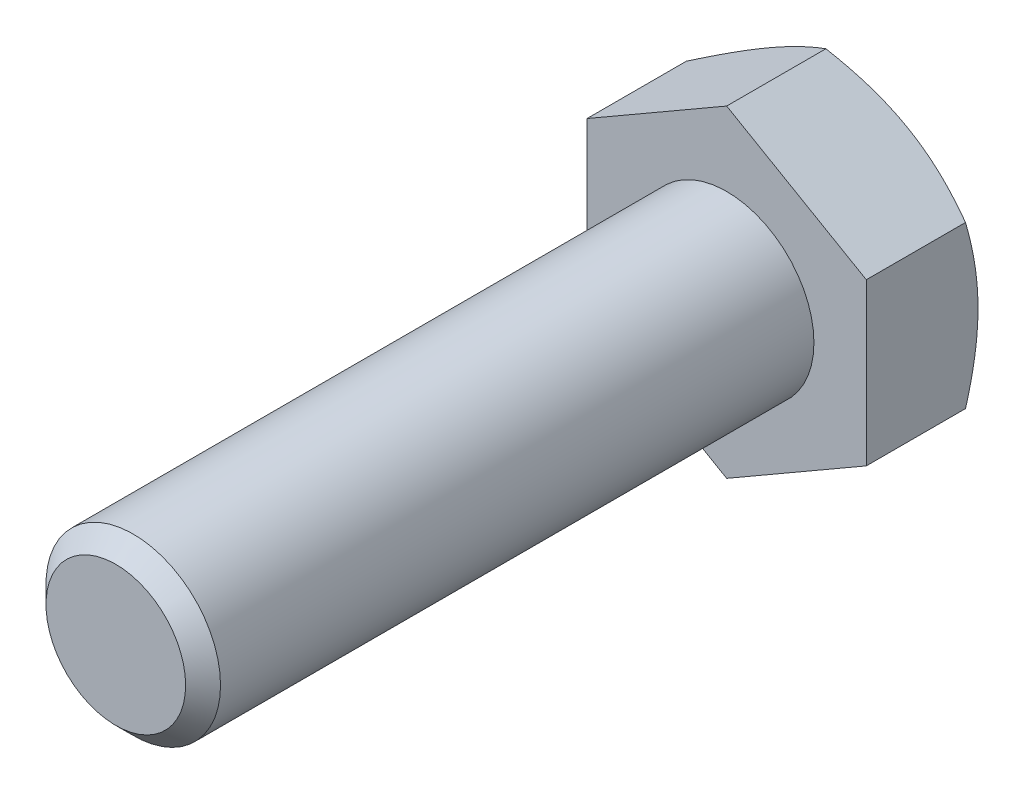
ISO-10303-21;
HEADER;
FILE_DESCRIPTION(('STEP AP214'),'2;1');
FILE_NAME('part.step','',(''),(''),'','','');
FILE_SCHEMA(('AUTOMOTIVE_DESIGN { 1 0 10303 214 1 1 1 1 }'));
ENDSEC;
DATA;
#1=APPLICATION_CONTEXT('core data for automotive mechanical design processes');
#2=APPLICATION_PROTOCOL_DEFINITION('international standard','automotive_design',2000,#1);
#3=PRODUCT_CONTEXT('',#1,'mechanical');
#4=PRODUCT('Part','Part','',(#3));
#5=PRODUCT_RELATED_PRODUCT_CATEGORY('part','',(#4));
#6=PRODUCT_DEFINITION_FORMATION('','',#4);
#7=PRODUCT_DEFINITION_CONTEXT('part definition',#1,'design');
#8=PRODUCT_DEFINITION('design','',#6,#7);
#9=PRODUCT_DEFINITION_SHAPE('','',#8);
#10=(LENGTH_UNIT() NAMED_UNIT(*) SI_UNIT(.MILLI.,.METRE.));
#11=(NAMED_UNIT(*) PLANE_ANGLE_UNIT() SI_UNIT($,.RADIAN.));
#12=(NAMED_UNIT(*) SI_UNIT($,.STERADIAN.) SOLID_ANGLE_UNIT());
#13=UNCERTAINTY_MEASURE_WITH_UNIT(LENGTH_MEASURE(1.E-05),#10,'distance_accuracy_value','');
#14=(GEOMETRIC_REPRESENTATION_CONTEXT(3) GLOBAL_UNCERTAINTY_ASSIGNED_CONTEXT((#13)) GLOBAL_UNIT_ASSIGNED_CONTEXT((#10,
#11,#12)) REPRESENTATION_CONTEXT('',''));
#15=CARTESIAN_POINT('',(0.,0.,0.));
#16=DIRECTION('',(0.,0.,1.));
#17=DIRECTION('',(1.,0.,0.));
#18=AXIS2_PLACEMENT_3D('',#15,#16,#17);
#19=CARTESIAN_POINT('',(0.,-2.22044604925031E-13,35.));
#20=DIRECTION('',(0.,0.,1.));
#21=DIRECTION('',(1.,0.,0.));
#22=AXIS2_PLACEMENT_3D('',#19,#20,#21);
#23=PLANE('',#22);
#24=CARTESIAN_POINT('',(0.,-2.22044604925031E-13,35.));
#25=DIRECTION('',(0.,0.,1.));
#26=DIRECTION('',(1.,0.,0.));
#27=AXIS2_PLACEMENT_3D('',#24,#25,#26);
#28=CIRCLE('',#27,4.);
#29=CARTESIAN_POINT('',(4.00000000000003,-2.21610326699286E-13,35.));
#30=VERTEX_POINT('',#29);
#31=EDGE_CURVE('E211',#30,#30,#28,.T.);
#32=ORIENTED_EDGE('',*,*,#31,.T.);
#33=EDGE_LOOP('',(#32));
#34=FACE_BOUND('',#33,.T.);
#35=ADVANCED_FACE('F37',(#34),#23,.T.);
#36=CARTESIAN_POINT('',(0.,0.,0.));
#37=DIRECTION('',(0.,0.,1.));
#38=DIRECTION('',(1.,0.,0.));
#39=AXIS2_PLACEMENT_3D('',#36,#37,#38);
#40=CYLINDRICAL_SURFACE('',#39,5.);
#41=CARTESIAN_POINT('',(0.,-1.38777878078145E-13,34.));
#42=DIRECTION('',(0.,0.,1.));
#43=DIRECTION('',(1.,0.,0.));
#44=AXIS2_PLACEMENT_3D('',#41,#42,#43);
#45=CIRCLE('',#44,5.);
#46=CARTESIAN_POINT('',(4.99999999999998,-1.38235030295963E-13,34.));
#47=VERTEX_POINT('',#46);
#48=EDGE_CURVE('E213',#47,#47,#45,.F.);
#49=ORIENTED_EDGE('',*,*,#48,.T.);
#50=EDGE_LOOP('',(#49));
#51=FACE_BOUND('',#50,.T.);
#52=CARTESIAN_POINT('',(0.,0.,0.));
#53=DIRECTION('',(0.,0.,1.));
#54=DIRECTION('',(1.,0.,0.));
#55=AXIS2_PLACEMENT_3D('',#52,#53,#54);
#56=CIRCLE('',#55,5.);
#57=CARTESIAN_POINT('',(5.00000000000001,0.,0.));
#58=VERTEX_POINT('',#57);
#59=EDGE_CURVE('E214',#58,#58,#56,.F.);
#60=ORIENTED_EDGE('',*,*,#59,.F.);
#61=EDGE_LOOP('',(#60));
#62=FACE_BOUND('',#61,.T.);
#63=ADVANCED_FACE('F202',(#51,#62),#40,.T.);
#64=CARTESIAN_POINT('',(0.,-2.22044604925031E-13,35.));
#65=DIRECTION('',(0.,0.,-1.));
#66=DIRECTION('',(-1.,0.,0.));
#67=AXIS2_PLACEMENT_3D('',#64,#65,#66);
#68=CONICAL_SURFACE('',#67,4.,0.785398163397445);
#69=ORIENTED_EDGE('',*,*,#48,.F.);
#70=EDGE_LOOP('',(#69));
#71=FACE_BOUND('',#70,.T.);
#72=ORIENTED_EDGE('',*,*,#31,.F.);
#73=EDGE_LOOP('',(#72));
#74=FACE_BOUND('',#73,.T.);
#75=ADVANCED_FACE('F207',(#71,#74),#68,.T.);
#76=CARTESIAN_POINT('',(0.,9.23760430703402,-6.39999999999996));
#77=DIRECTION('',(0.499999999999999,0.866025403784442,0.));
#78=DIRECTION('',(-0.866025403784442,0.499999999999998,0.));
#79=AXIS2_PLACEMENT_3D('',#76,#77,#78);
#80=PLANE('',#79);
#81=CARTESIAN_POINT('',(-0.000200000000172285,9.23771977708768,-5.685402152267));
#82=CARTESIAN_POINT('',(0.175648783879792,9.13619343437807,-5.74400928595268));
#83=CARTESIAN_POINT('',(0.352153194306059,9.03428856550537,-5.79995659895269));
#84=CARTESIAN_POINT('',(0.706595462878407,8.829651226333,-5.90579899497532));
#85=CARTESIAN_POINT('',(0.884533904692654,8.72691841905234,-5.95569146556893));
#86=CARTESIAN_POINT('',(1.42119823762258,8.41707512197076,-6.09530720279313));
#87=CARTESIAN_POINT('',(1.78204258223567,8.20874154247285,-6.17471882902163));
#88=CARTESIAN_POINT('',(2.322039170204,7.89697436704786,-6.26783835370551));
#89=CARTESIAN_POINT('',(2.49957818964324,7.79447216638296,-6.29436541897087));
#90=CARTESIAN_POINT('',(2.85545911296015,7.58900421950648,-6.33884682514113));
#91=CARTESIAN_POINT('',(3.03380094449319,7.48603851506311,-6.35680192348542));
#92=CARTESIAN_POINT('',(3.39079168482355,7.27992981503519,-6.38368435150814));
#93=CARTESIAN_POINT('',(3.56944001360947,7.17678715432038,-6.39262192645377));
#94=CARTESIAN_POINT('',(3.92690170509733,6.97040655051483,-6.40127769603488));
#95=CARTESIAN_POINT('',(4.10571506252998,6.86716861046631,-6.40099617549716));
#96=CARTESIAN_POINT('',(4.44001336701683,6.6741613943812,-6.39185497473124));
#97=CARTESIAN_POINT('',(4.59552190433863,6.58437849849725,-6.38411039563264));
#98=CARTESIAN_POINT('',(4.9061747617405,6.40502298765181,-6.36179886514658));
#99=CARTESIAN_POINT('',(5.06131905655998,6.31545038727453,-6.34723145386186));
#100=CARTESIAN_POINT('',(5.5261513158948,6.04707935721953,-6.29363930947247));
#101=CARTESIAN_POINT('',(5.83501648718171,5.86875596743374,-6.24473135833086));
#102=CARTESIAN_POINT('',(6.45602322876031,5.51021755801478,-6.12246059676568));
#103=CARTESIAN_POINT('',(6.7680855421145,5.3300482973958,-6.04857947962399));
#104=CARTESIAN_POINT('',(7.38755648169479,4.97239658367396,-5.88089985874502));
#105=CARTESIAN_POINT('',(7.69497304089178,4.7949095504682,-5.78714073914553));
#106=CARTESIAN_POINT('',(8.00020000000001,4.61868668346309,-5.68540215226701));
#107=B_SPLINE_CURVE_WITH_KNOTS('',3,(#81,#82,#83,#84,#85,#86,#87,#88,#89,#90,#91,#92,#93,#94,
#95,#96,#97,#98,#99,#100,#101,#102,#103,#104,#105,#106),.UNSPECIFIED.,.F.,.F.,(4,2,2,2,2,2,2,2,
2,2,2,2,4),(0.,0.633973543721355,1.26821965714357,2.53934712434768,3.15934343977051,
3.77928496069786,4.39852133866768,5.01773858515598,5.55680239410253,6.09590254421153,
7.17487077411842,8.27776850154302,9.37850115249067),.UNSPECIFIED.);
#108=CARTESIAN_POINT('',(0.,9.23760430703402,-5.68546882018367));
#109=VERTEX_POINT('',#108);
#110=CARTESIAN_POINT('',(3.99999999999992,6.92820323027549,-6.39999999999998));
#111=VERTEX_POINT('',#110);
#112=EDGE_CURVE('E247',#109,#111,#107,.T.);
#113=ORIENTED_EDGE('',*,*,#112,.F.);
#114=DIRECTION('',(0.,0.,1.));
#115=VECTOR('',#114,1.);
#116=CARTESIAN_POINT('',(0.,9.23760430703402,-6.39999999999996));
#117=LINE('',#116,#115);
#118=CARTESIAN_POINT('',(0.,9.23760430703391,0.));
#119=VERTEX_POINT('',#118);
#120=EDGE_CURVE('E221',#109,#119,#117,.T.);
#121=ORIENTED_EDGE('',*,*,#120,.T.);
#122=DIRECTION('',(-0.866025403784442,0.499999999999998,0.));
#123=VECTOR('',#122,1.);
#124=CARTESIAN_POINT('',(0.,9.23760430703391,0.));
#125=LINE('',#124,#123);
#126=CARTESIAN_POINT('',(7.99999999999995,4.61880215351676,0.));
#127=VERTEX_POINT('',#126);
#128=EDGE_CURVE('E245',#127,#119,#125,.T.);
#129=ORIENTED_EDGE('',*,*,#128,.F.);
#130=DIRECTION('',(0.,0.,1.));
#131=VECTOR('',#130,1.);
#132=CARTESIAN_POINT('',(8.00000000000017,4.61880215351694,-6.39999999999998));
#133=LINE('',#132,#131);
#134=CARTESIAN_POINT('',(7.99999999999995,4.61880215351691,-5.68546882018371));
#135=VERTEX_POINT('',#134);
#136=EDGE_CURVE('E218',#135,#127,#133,.T.);
#137=ORIENTED_EDGE('',*,*,#136,.F.);
#138=EDGE_CURVE('E177',#111,#135,#107,.T.);
#139=ORIENTED_EDGE('',*,*,#138,.F.);
#140=EDGE_LOOP('',(#113,#121,#129,#137,#139));
#141=FACE_BOUND('',#140,.T.);
#142=ADVANCED_FACE('F187',(#141),#80,.T.);
#143=CARTESIAN_POINT('',(8.00000000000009,-4.61880215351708,-6.39999999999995));
#144=DIRECTION('',(1.,0.,0.));
#145=DIRECTION('',(0.,1.,0.));
#146=AXIS2_PLACEMENT_3D('',#143,#144,#145);
#147=PLANE('',#146);
#148=CARTESIAN_POINT('',(7.99999999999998,-12.5978512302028,-2.40281206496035));
#149=CARTESIAN_POINT('',(8.00000000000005,-12.2467461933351,-2.57388946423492));
#150=CARTESIAN_POINT('',(8.00000000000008,-11.8948553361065,-2.74338074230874));
#151=CARTESIAN_POINT('',(8.0000000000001,-11.1890846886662,-3.07830251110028));
#152=CARTESIAN_POINT('',(8.00000000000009,-10.835204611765,-3.24373239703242));
#153=CARTESIAN_POINT('',(8.00000000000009,-10.123305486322,-3.57043443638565));
#154=CARTESIAN_POINT('',(8.00000000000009,-9.76527449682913,-3.73168065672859));
#155=CARTESIAN_POINT('',(8.00000000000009,-9.04643054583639,-4.04782365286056));
#156=CARTESIAN_POINT('',(8.00000000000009,-8.68561771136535,-4.20272071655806));
#157=CARTESIAN_POINT('',(8.00000000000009,-7.94836823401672,-4.50960168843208));
#158=CARTESIAN_POINT('',(8.00000000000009,-7.57181608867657,-4.66130959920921));
#159=CARTESIAN_POINT('',(8.00000000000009,-6.81437869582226,-4.95369969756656));
#160=CARTESIAN_POINT('',(8.00000000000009,-6.43349297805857,-5.09438067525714));
#161=CARTESIAN_POINT('',(8.00000000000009,-5.66743059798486,-5.36116349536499));
#162=CARTESIAN_POINT('',(8.00000000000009,-5.28226375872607,-5.48729325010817));
#163=CARTESIAN_POINT('',(8.00000000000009,-4.50642197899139,-5.7210548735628));
#164=CARTESIAN_POINT('',(8.00000000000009,-4.1157487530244,-5.82869236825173));
#165=CARTESIAN_POINT('',(8.00000000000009,-3.3307685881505,-6.01985550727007));
#166=CARTESIAN_POINT('',(8.00000000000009,-2.93649538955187,-6.10351603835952));
#167=CARTESIAN_POINT('',(8.00000000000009,-2.34134760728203,-6.20749259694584));
#168=CARTESIAN_POINT('',(8.00000000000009,-2.14232908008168,-6.23856705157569));
#169=CARTESIAN_POINT('',(8.00000000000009,-1.74323916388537,-6.29294025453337));
#170=CARTESIAN_POINT('',(8.00000000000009,-1.54316787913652,-6.31623975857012));
#171=CARTESIAN_POINT('',(8.00000000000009,-1.14493807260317,-6.3542962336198));
#172=CARTESIAN_POINT('',(8.0000000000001,-0.946790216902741,-6.36916434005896));
#173=CARTESIAN_POINT('',(8.00000000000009,-0.55004265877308,-6.3905000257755));
#174=CARTESIAN_POINT('',(8.00000000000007,-0.351442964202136,-6.39696775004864));
#175=CARTESIAN_POINT('',(8.00000000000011,0.0458536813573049,-6.40134753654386));
#176=CARTESIAN_POINT('',(8.00000000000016,0.244550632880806,-6.39925955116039));
#177=CARTESIAN_POINT('',(8.00000000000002,0.641675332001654,-6.38658102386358));
#178=CARTESIAN_POINT('',(7.99999999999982,0.840103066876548,-6.3759900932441));
#179=CARTESIAN_POINT('',(7.99999999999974,1.31123186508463,-6.34097810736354));
#180=CARTESIAN_POINT('',(7.99999999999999,1.58366327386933,-6.31284309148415));
#181=CARTESIAN_POINT('',(8.00000000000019,2.12661564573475,-6.24203710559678));
#182=CARTESIAN_POINT('',(8.00000000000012,2.39713636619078,-6.19936432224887));
#183=CARTESIAN_POINT('',(8.00000000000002,3.20545284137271,-6.05179305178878));
#184=CARTESIAN_POINT('',(8.00000000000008,3.73973646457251,-5.92736416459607));
#185=CARTESIAN_POINT('',(8.0000000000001,4.53906436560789,-5.7101299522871));
#186=CARTESIAN_POINT('',(8.00000000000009,4.80821183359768,-5.6315418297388));
#187=CARTESIAN_POINT('',(8.00000000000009,5.34389592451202,-5.46584170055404));
#188=CARTESIAN_POINT('',(8.00000000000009,5.61043252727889,-5.37872962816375));
#189=CARTESIAN_POINT('',(8.00000000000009,6.14097486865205,-5.19740915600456));
#190=CARTESIAN_POINT('',(8.0000000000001,6.4049812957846,-5.10320275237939));
#191=CARTESIAN_POINT('',(8.00000000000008,6.93077992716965,-4.90883812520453));
#192=CARTESIAN_POINT('',(8.00000000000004,7.19257218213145,-4.8086800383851));
#193=CARTESIAN_POINT('',(8.00000000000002,7.89757234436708,-4.53123135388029));
#194=CARTESIAN_POINT('',(8.00000000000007,8.33892089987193,-4.34922056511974));
#195=CARTESIAN_POINT('',(8.00000000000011,9.21706508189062,-3.97449001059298));
#196=CARTESIAN_POINT('',(8.0000000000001,9.65386019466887,-3.78176905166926));
#197=CARTESIAN_POINT('',(8.00000000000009,10.5239434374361,-3.38815487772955));
#198=CARTESIAN_POINT('',(8.00000000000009,10.9572301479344,-3.18725853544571));
#199=CARTESIAN_POINT('',(8.00000000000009,11.8208356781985,-2.77925077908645));
#200=CARTESIAN_POINT('',(8.00000000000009,12.251154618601,-2.57213961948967));
#201=CARTESIAN_POINT('',(8.00000000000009,13.110106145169,-2.15271844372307));
#202=CARTESIAN_POINT('',(8.00000000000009,13.5387348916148,-1.94040058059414));
#203=CARTESIAN_POINT('',(8.00000000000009,14.3940561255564,-1.51189757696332));
#204=CARTESIAN_POINT('',(8.00000000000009,14.820748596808,-1.29571240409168));
#205=CARTESIAN_POINT('',(8.00000000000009,15.672448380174,-0.860283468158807));
#206=CARTESIAN_POINT('',(8.00000000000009,16.0974560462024,-0.641040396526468));
#207=CARTESIAN_POINT('',(8.00000000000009,16.9461557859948,-0.200021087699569));
#208=CARTESIAN_POINT('',(8.00000000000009,17.3698478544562,0.021755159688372));
#209=CARTESIAN_POINT('',(8.00000000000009,18.5495919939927,0.642968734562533));
#210=CARTESIAN_POINT('',(8.00000000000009,19.3044430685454,1.0446864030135));
#211=CARTESIAN_POINT('',(8.00000000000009,20.8116128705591,1.85294502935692));
#212=CARTESIAN_POINT('',(8.00000000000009,21.5639314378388,2.25948628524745));
#213=CARTESIAN_POINT('',(8.00000000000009,23.0640825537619,3.07479055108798));
#214=CARTESIAN_POINT('',(8.00000000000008,23.8119216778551,3.48354147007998));
#215=CARTESIAN_POINT('',(8.0000000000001,24.9325210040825,4.09870759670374));
#216=CARTESIAN_POINT('',(8.0000000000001,25.3058462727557,4.30409483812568));
#217=CARTESIAN_POINT('',(8.00000000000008,26.0521604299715,4.71547851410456));
#218=CARTESIAN_POINT('',(8.00000000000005,26.4251493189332,4.92147494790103));
#219=CARTESIAN_POINT('',(7.99999999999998,26.7979906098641,5.12773824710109));
#220=B_SPLINE_CURVE_WITH_KNOTS('',3,(#148,#149,#150,#151,#152,#153,#154,#155,#156,#157,#158,
#159,#160,#161,#162,#163,#164,#165,#166,#167,#168,#169,#170,#171,#172,#173,#174,#175,#176,#177,
#178,#179,#180,#181,#182,#183,#184,#185,#186,#187,#188,#189,#190,#191,#192,#193,#194,#195,#196,
#197,#198,#199,#200,#201,#202,#203,#204,#205,#206,#207,#208,#209,#210,#211,#212,#213,#214,#215,
#216,#217,#218,#219),.UNSPECIFIED.,.F.,.F.,(4,2,2,2,2,2,2,2,2,2,2,2,2,2,2,2,2,2,2,2,2,2,2,2,2,2,
2,2,2,2,2,2,2,2,2,4),(0.,1.17171303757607,2.34359951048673,3.5215477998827,4.69944261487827,
5.91720060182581,7.13509201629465,8.35060698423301,9.56575149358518,10.7739194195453,
11.3780811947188,11.982184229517,12.5781274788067,13.174060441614,13.7699967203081,
14.3659602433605,15.1871414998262,16.0084252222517,17.651791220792,18.4928743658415,
19.3339639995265,20.1748178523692,21.0156523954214,22.4476587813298,23.8798250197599,
25.312544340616,26.7452050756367,28.1801767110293,29.6151603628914,31.0498246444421,
32.4844947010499,35.0497345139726,37.6151336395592,40.1718943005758,41.4501744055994,
42.7284529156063),.UNSPECIFIED.);
#221=CARTESIAN_POINT('',(8.00000000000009,-1.38777878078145E-13,-6.4));
#222=VERTEX_POINT('',#221);
#223=EDGE_CURVE('E175',#135,#222,#220,.F.);
#224=ORIENTED_EDGE('',*,*,#223,.F.);
#225=ORIENTED_EDGE('',*,*,#136,.T.);
#226=DIRECTION('',(0.,1.,0.));
#227=VECTOR('',#226,1.);
#228=CARTESIAN_POINT('',(8.00000000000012,-4.61880215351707,0.));
#229=LINE('',#228,#227);
#230=CARTESIAN_POINT('',(8.00000000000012,-4.61880215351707,0.));
#231=VERTEX_POINT('',#230);
#232=EDGE_CURVE('E223',#231,#127,#229,.T.);
#233=ORIENTED_EDGE('',*,*,#232,.F.);
#234=DIRECTION('',(0.,0.,1.));
#235=VECTOR('',#234,1.);
#236=CARTESIAN_POINT('',(8.00000000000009,-4.61880215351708,-6.39999999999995));
#237=LINE('',#236,#235);
#238=CARTESIAN_POINT('',(8.00000000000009,-4.61880215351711,-5.68546882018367));
#239=VERTEX_POINT('',#238);
#240=EDGE_CURVE('E229',#239,#231,#237,.T.);
#241=ORIENTED_EDGE('',*,*,#240,.F.);
#242=EDGE_CURVE('E170',#222,#239,#220,.F.);
#243=ORIENTED_EDGE('',*,*,#242,.F.);
#244=EDGE_LOOP('',(#224,#225,#233,#241,#243));
#245=FACE_BOUND('',#244,.T.);
#246=ADVANCED_FACE('F183',(#245),#147,.T.);
#247=CARTESIAN_POINT('',(-1.66533453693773E-13,-9.23760430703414,-6.4));
#248=DIRECTION('',(0.499999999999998,-0.866025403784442,0.));
#249=DIRECTION('',(0.866025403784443,0.499999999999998,0.));
#250=AXIS2_PLACEMENT_3D('',#247,#248,#249);
#251=PLANE('',#250);
#252=CARTESIAN_POINT('',(8.00020000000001,-4.61868668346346,-5.68540215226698));
#253=CARTESIAN_POINT('',(7.82435121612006,-4.72021302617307,-5.74400928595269));
#254=CARTESIAN_POINT('',(7.64784680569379,-4.82211789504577,-5.7999565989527));
#255=CARTESIAN_POINT('',(7.29340453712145,-5.02675523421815,-5.90579899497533));
#256=CARTESIAN_POINT('',(7.1154660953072,-5.1294880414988,-5.95569146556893));
#257=CARTESIAN_POINT('',(6.57880176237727,-5.43933133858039,-6.09530720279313));
#258=CARTESIAN_POINT('',(6.21795741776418,-5.6476649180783,-6.17471882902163));
#259=CARTESIAN_POINT('',(5.67796082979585,-5.95943209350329,-6.2678383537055));
#260=CARTESIAN_POINT('',(5.50042181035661,-6.06193429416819,-6.29436541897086));
#261=CARTESIAN_POINT('',(5.14454088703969,-6.26740224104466,-6.33884682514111));
#262=CARTESIAN_POINT('',(4.96619905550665,-6.37036794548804,-6.35680192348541));
#263=CARTESIAN_POINT('',(4.60920831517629,-6.57647664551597,-6.38368435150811));
#264=CARTESIAN_POINT('',(4.43055998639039,-6.6796193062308,-6.39262192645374));
#265=CARTESIAN_POINT('',(4.0730982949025,-6.88599991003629,-6.40127769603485));
#266=CARTESIAN_POINT('',(3.8942849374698,-6.98923785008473,-6.40099617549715));
#267=CARTESIAN_POINT('',(3.55998663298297,-7.18224506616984,-6.39185497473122));
#268=CARTESIAN_POINT('',(3.40447809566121,-7.27202796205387,-6.3841103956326));
#269=CARTESIAN_POINT('',(3.09382523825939,-7.45138347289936,-6.36179886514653));
#270=CARTESIAN_POINT('',(2.9386809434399,-7.54095607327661,-6.34723145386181));
#271=CARTESIAN_POINT('',(2.47384868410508,-7.80932710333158,-6.29363930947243));
#272=CARTESIAN_POINT('',(2.16498351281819,-7.98765049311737,-6.24473135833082));
#273=CARTESIAN_POINT('',(1.54397677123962,-8.34618890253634,-6.12246059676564));
#274=CARTESIAN_POINT('',(1.23191445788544,-8.5263581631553,-6.04857947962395));
#275=CARTESIAN_POINT('',(0.612443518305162,-8.88400987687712,-5.88089985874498));
#276=CARTESIAN_POINT('',(0.305026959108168,-9.06149691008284,-5.78714073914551));
#277=CARTESIAN_POINT('',(-0.000200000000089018,-9.23771977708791,-5.68540215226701));
#278=B_SPLINE_CURVE_WITH_KNOTS('',3,(#252,#253,#254,#255,#256,#257,#258,#259,#260,#261,#262,
#263,#264,#265,#266,#267,#268,#269,#270,#271,#272,#273,#274,#275,#276,#277),.UNSPECIFIED.,.F.,
.F.,(4,2,2,2,2,2,2,2,2,2,2,2,4),(0.,0.633973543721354,1.26821965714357,2.53934712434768,
3.15934343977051,3.77928496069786,4.39852133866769,5.01773858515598,5.55680239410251,
6.09590254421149,7.17487077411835,8.27776850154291,9.37850115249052),.UNSPECIFIED.);
#279=CARTESIAN_POINT('',(4.00000000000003,-6.92820323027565,-6.39999999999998));
#280=VERTEX_POINT('',#279);
#281=EDGE_CURVE('E176',#239,#280,#278,.T.);
#282=ORIENTED_EDGE('',*,*,#281,.F.);
#283=ORIENTED_EDGE('',*,*,#240,.T.);
#284=DIRECTION('',(0.866025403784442,0.499999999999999,0.));
#285=VECTOR('',#284,1.);
#286=CARTESIAN_POINT('',(-1.38777878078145E-13,-9.23760430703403,0.));
#287=LINE('',#286,#285);
#288=CARTESIAN_POINT('',(-1.38777878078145E-13,-9.23760430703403,0.));
#289=VERTEX_POINT('',#288);
#290=EDGE_CURVE('E234',#289,#231,#287,.T.);
#291=ORIENTED_EDGE('',*,*,#290,.F.);
#292=DIRECTION('',(0.,0.,1.));
#293=VECTOR('',#292,1.);
#294=CARTESIAN_POINT('',(-1.66533453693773E-13,-9.23760430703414,-6.4));
#295=LINE('',#294,#293);
#296=CARTESIAN_POINT('',(0.,-9.23760430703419,-5.68546882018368));
#297=VERTEX_POINT('',#296);
#298=EDGE_CURVE('E227',#297,#289,#295,.T.);
#299=ORIENTED_EDGE('',*,*,#298,.F.);
#300=EDGE_CURVE('E164',#280,#297,#278,.T.);
#301=ORIENTED_EDGE('',*,*,#300,.F.);
#302=EDGE_LOOP('',(#282,#283,#291,#299,#301));
#303=FACE_BOUND('',#302,.T.);
#304=ADVANCED_FACE('F186',(#303),#251,.T.);
#305=CARTESIAN_POINT('',(-1.66533453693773E-13,-9.23760430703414,-6.4));
#306=DIRECTION('',(-0.500000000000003,-0.866025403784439,0.));
#307=DIRECTION('',(0.86602540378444,-0.500000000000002,0.));
#308=AXIS2_PLACEMENT_3D('',#305,#306,#307);
#309=PLANE('',#308);
#310=CARTESIAN_POINT('',(0.000200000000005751,-9.23771977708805,-5.68540215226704));
#311=CARTESIAN_POINT('',(-0.175648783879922,-9.13619343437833,-5.74400928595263));
#312=CARTESIAN_POINT('',(-0.352153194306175,-9.03428856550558,-5.7999565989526));
#313=CARTESIAN_POINT('',(-0.706595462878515,-8.82965122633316,-5.9057989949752));
#314=CARTESIAN_POINT('',(-0.884533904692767,-8.72691841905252,-5.95569146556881));
#315=CARTESIAN_POINT('',(-1.42119823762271,-8.41707512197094,-6.09530720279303));
#316=CARTESIAN_POINT('',(-1.78204258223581,-8.20874154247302,-6.17471882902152));
#317=CARTESIAN_POINT('',(-2.32203917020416,-7.89697436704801,-6.2678383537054));
#318=CARTESIAN_POINT('',(-2.4995781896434,-7.7944721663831,-6.29436541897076));
#319=CARTESIAN_POINT('',(-2.85545911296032,-7.58900421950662,-6.33884682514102));
#320=CARTESIAN_POINT('',(-3.03380094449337,-7.48603851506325,-6.35680192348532));
#321=CARTESIAN_POINT('',(-3.39079168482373,-7.2799298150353,-6.38368435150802));
#322=CARTESIAN_POINT('',(-3.56944001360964,-7.17678715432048,-6.39262192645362));
#323=CARTESIAN_POINT('',(-3.92690170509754,-6.97040655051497,-6.4012776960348));
#324=CARTESIAN_POINT('',(-4.10571506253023,-6.86716861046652,-6.40099617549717));
#325=CARTESIAN_POINT('',(-4.44001336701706,-6.67416139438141,-6.39185497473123));
#326=CARTESIAN_POINT('',(-4.59552190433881,-6.5843784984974,-6.38411039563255));
#327=CARTESIAN_POINT('',(-4.90617476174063,-6.40502298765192,-6.36179886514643));
#328=CARTESIAN_POINT('',(-5.06131905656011,-6.31545038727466,-6.34723145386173));
#329=CARTESIAN_POINT('',(-5.52615131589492,-6.04707935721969,-6.29363930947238));
#330=CARTESIAN_POINT('',(-5.83501648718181,-5.8687559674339,-6.24473135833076));
#331=CARTESIAN_POINT('',(-6.45602322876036,-5.51021755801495,-6.12246059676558));
#332=CARTESIAN_POINT('',(-6.76808554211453,-5.33004829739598,-6.0485794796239));
#333=CARTESIAN_POINT('',(-7.38755648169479,-4.97239658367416,-5.88089985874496));
#334=CARTESIAN_POINT('',(-7.69497304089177,-4.79490955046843,-5.78714073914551));
#335=CARTESIAN_POINT('',(-8.00020000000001,-4.61868668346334,-5.68540215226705));
#336=B_SPLINE_CURVE_WITH_KNOTS('',3,(#310,#311,#312,#313,#314,#315,#316,#317,#318,#319,#320,
#321,#322,#323,#324,#325,#326,#327,#328,#329,#330,#331,#332,#333,#334,#335),.UNSPECIFIED.,.F.,
.F.,(4,2,2,2,2,2,2,2,2,2,2,2,4),(0.,0.63397354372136,1.26821965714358,2.53934712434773,
3.15934343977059,3.77928496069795,4.39852133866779,5.01773858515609,5.5568023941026,
6.09590254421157,7.1748707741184,8.27776850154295,9.37850115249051),.UNSPECIFIED.);
#337=CARTESIAN_POINT('',(-4.00000000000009,-6.92820323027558,-6.40000000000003));
#338=VERTEX_POINT('',#337);
#339=EDGE_CURVE('E266',#297,#338,#336,.T.);
#340=ORIENTED_EDGE('',*,*,#339,.F.);
#341=ORIENTED_EDGE('',*,*,#298,.T.);
#342=DIRECTION('',(0.86602540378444,-0.500000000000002,0.));
#343=VECTOR('',#342,1.);
#344=CARTESIAN_POINT('',(-1.38777878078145E-13,-9.23760430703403,0.));
#345=LINE('',#344,#343);
#346=CARTESIAN_POINT('',(-8.00000000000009,-4.61880215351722,0.));
#347=VERTEX_POINT('',#346);
#348=EDGE_CURVE('E237',#347,#289,#345,.T.);
#349=ORIENTED_EDGE('',*,*,#348,.F.);
#350=DIRECTION('',(0.,0.,1.));
#351=VECTOR('',#350,1.);
#352=CARTESIAN_POINT('',(-8.00000000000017,-4.61880215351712,-6.40000000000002));
#353=LINE('',#352,#351);
#354=CARTESIAN_POINT('',(-8.00000000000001,-4.6188021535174,-5.68546882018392));
#355=VERTEX_POINT('',#354);
#356=EDGE_CURVE('E225',#355,#347,#353,.T.);
#357=ORIENTED_EDGE('',*,*,#356,.F.);
#358=EDGE_CURVE('E113',#338,#355,#336,.T.);
#359=ORIENTED_EDGE('',*,*,#358,.F.);
#360=EDGE_LOOP('',(#340,#341,#349,#357,#359));
#361=FACE_BOUND('',#360,.T.);
#362=ADVANCED_FACE('F191',(#361),#309,.T.);
#363=CARTESIAN_POINT('',(-8.00000000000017,-4.61880215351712,-6.40000000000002));
#364=DIRECTION('',(-1.,0.,0.));
#365=DIRECTION('',(0.,0.,1.));
#366=AXIS2_PLACEMENT_3D('',#363,#364,#365);
#367=PLANE('',#366);
#368=CARTESIAN_POINT('',(-8.00000000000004,-12.5978512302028,-2.40281206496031));
#369=CARTESIAN_POINT('',(-8.00000000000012,-12.246746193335,-2.5738894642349));
#370=CARTESIAN_POINT('',(-8.00000000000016,-11.8948553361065,-2.74338074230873));
#371=CARTESIAN_POINT('',(-8.00000000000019,-11.1890846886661,-3.07830251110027));
#372=CARTESIAN_POINT('',(-8.00000000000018,-10.835204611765,-3.24373239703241));
#373=CARTESIAN_POINT('',(-8.00000000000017,-10.1233054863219,-3.57043443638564));
#374=CARTESIAN_POINT('',(-8.00000000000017,-9.76527449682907,-3.73168065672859));
#375=CARTESIAN_POINT('',(-8.00000000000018,-9.04643054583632,-4.04782365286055));
#376=CARTESIAN_POINT('',(-8.00000000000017,-8.68561771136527,-4.20272071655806));
#377=CARTESIAN_POINT('',(-8.00000000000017,-7.94836823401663,-4.50960168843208));
#378=CARTESIAN_POINT('',(-8.00000000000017,-7.57181608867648,-4.66130959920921));
#379=CARTESIAN_POINT('',(-8.00000000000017,-6.81437869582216,-4.95369969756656));
#380=CARTESIAN_POINT('',(-8.00000000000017,-6.43349297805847,-5.09438067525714));
#381=CARTESIAN_POINT('',(-8.00000000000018,-5.66743059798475,-5.36116349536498));
#382=CARTESIAN_POINT('',(-8.00000000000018,-5.28226375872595,-5.48729325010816));
#383=CARTESIAN_POINT('',(-8.00000000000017,-4.50642197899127,-5.7210548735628));
#384=CARTESIAN_POINT('',(-8.00000000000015,-4.11574875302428,-5.82869236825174));
#385=CARTESIAN_POINT('',(-8.00000000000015,-3.33076858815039,-6.01985550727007));
#386=CARTESIAN_POINT('',(-8.00000000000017,-2.93649538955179,-6.10351603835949));
#387=CARTESIAN_POINT('',(-8.00000000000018,-2.34134760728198,-6.2074925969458));
#388=CARTESIAN_POINT('',(-8.00000000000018,-2.14232908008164,-6.23856705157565));
#389=CARTESIAN_POINT('',(-8.00000000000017,-1.74323916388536,-6.29294025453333));
#390=CARTESIAN_POINT('',(-8.00000000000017,-1.54316787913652,-6.31623975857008));
#391=CARTESIAN_POINT('',(-8.00000000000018,-1.14493807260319,-6.35429623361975));
#392=CARTESIAN_POINT('',(-8.00000000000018,-0.946790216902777,-6.36916434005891));
#393=CARTESIAN_POINT('',(-8.00000000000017,-0.55004265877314,-6.39050002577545));
#394=CARTESIAN_POINT('',(-8.00000000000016,-0.351442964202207,-6.39696775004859));
#395=CARTESIAN_POINT('',(-8.00000000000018,0.0458536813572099,-6.40134753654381));
#396=CARTESIAN_POINT('',(-8.00000000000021,0.244550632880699,-6.39925955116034));
#397=CARTESIAN_POINT('',(-8.00000000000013,0.641675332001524,-6.38658102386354));
#398=CARTESIAN_POINT('',(-8.00000000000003,0.840103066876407,-6.37599009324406));
#399=CARTESIAN_POINT('',(-7.99999999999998,1.31123186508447,-6.3409781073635));
#400=CARTESIAN_POINT('',(-8.00000000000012,1.58366327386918,-6.31284309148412));
#401=CARTESIAN_POINT('',(-8.00000000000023,2.1266156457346,-6.24203710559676));
#402=CARTESIAN_POINT('',(-8.00000000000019,2.39713636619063,-6.19936432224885));
#403=CARTESIAN_POINT('',(-8.00000000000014,3.20545284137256,-6.05179305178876));
#404=CARTESIAN_POINT('',(-8.00000000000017,3.73973646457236,-5.92736416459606));
#405=CARTESIAN_POINT('',(-8.00000000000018,4.53906436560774,-5.7101299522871));
#406=CARTESIAN_POINT('',(-8.00000000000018,4.80821183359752,-5.6315418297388));
#407=CARTESIAN_POINT('',(-8.00000000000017,5.34389592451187,-5.46584170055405));
#408=CARTESIAN_POINT('',(-8.00000000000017,5.61043252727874,-5.37872962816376));
#409=CARTESIAN_POINT('',(-8.00000000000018,6.1409748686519,-5.19740915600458));
#410=CARTESIAN_POINT('',(-8.00000000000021,6.40498129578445,-5.10320275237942));
#411=CARTESIAN_POINT('',(-8.00000000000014,6.93077992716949,-4.90883812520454));
#412=CARTESIAN_POINT('',(-8.00000000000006,7.19257218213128,-4.80868003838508));
#413=CARTESIAN_POINT('',(-7.99999999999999,7.89757234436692,-4.53123135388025));
#414=CARTESIAN_POINT('',(-8.00000000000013,8.33892089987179,-4.34922056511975));
#415=CARTESIAN_POINT('',(-8.00000000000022,9.21706508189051,-3.97449001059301));
#416=CARTESIAN_POINT('',(-8.00000000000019,9.65386019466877,-3.78176905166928));
#417=CARTESIAN_POINT('',(-8.00000000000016,10.523943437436,-3.38815487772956));
#418=CARTESIAN_POINT('',(-8.00000000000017,10.9572301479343,-3.18725853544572));
#419=CARTESIAN_POINT('',(-8.00000000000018,11.8208356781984,-2.77925077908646));
#420=CARTESIAN_POINT('',(-8.00000000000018,12.2511546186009,-2.57213961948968));
#421=CARTESIAN_POINT('',(-8.00000000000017,13.110106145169,-2.15271844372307));
#422=CARTESIAN_POINT('',(-8.00000000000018,13.5387348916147,-1.94040058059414));
#423=CARTESIAN_POINT('',(-8.00000000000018,14.3940561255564,-1.51189757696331));
#424=CARTESIAN_POINT('',(-8.00000000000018,14.820748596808,-1.29571240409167));
#425=CARTESIAN_POINT('',(-8.00000000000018,15.6724483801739,-0.860283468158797));
#426=CARTESIAN_POINT('',(-8.00000000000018,16.0974560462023,-0.641040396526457));
#427=CARTESIAN_POINT('',(-8.00000000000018,16.9461557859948,-0.200021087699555));
#428=CARTESIAN_POINT('',(-8.00000000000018,17.3698478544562,0.0217551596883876));
#429=CARTESIAN_POINT('',(-8.00000000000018,18.5495919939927,0.642968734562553));
#430=CARTESIAN_POINT('',(-8.00000000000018,19.3044430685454,1.04468640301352));
#431=CARTESIAN_POINT('',(-8.00000000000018,20.8116128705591,1.85294502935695));
#432=CARTESIAN_POINT('',(-8.00000000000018,21.5639314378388,2.25948628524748));
#433=CARTESIAN_POINT('',(-8.00000000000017,23.0640825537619,3.07479055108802));
#434=CARTESIAN_POINT('',(-8.00000000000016,23.8119216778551,3.48354147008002));
#435=CARTESIAN_POINT('',(-8.00000000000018,24.9325210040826,4.09870759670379));
#436=CARTESIAN_POINT('',(-8.0000000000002,25.3058462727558,4.30409483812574));
#437=CARTESIAN_POINT('',(-8.00000000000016,26.0521604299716,4.71547851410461));
#438=CARTESIAN_POINT('',(-8.0000000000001,26.4251493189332,4.92147494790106));
#439=CARTESIAN_POINT('',(-7.99999999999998,26.7979906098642,5.12773824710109));
#440=B_SPLINE_CURVE_WITH_KNOTS('',3,(#368,#369,#370,#371,#372,#373,#374,#375,#376,#377,#378,
#379,#380,#381,#382,#383,#384,#385,#386,#387,#388,#389,#390,#391,#392,#393,#394,#395,#396,#397,
#398,#399,#400,#401,#402,#403,#404,#405,#406,#407,#408,#409,#410,#411,#412,#413,#414,#415,#416,
#417,#418,#419,#420,#421,#422,#423,#424,#425,#426,#427,#428,#429,#430,#431,#432,#433,#434,#435,
#436,#437,#438,#439),.UNSPECIFIED.,.F.,.F.,(4,2,2,2,2,2,2,2,2,2,2,2,2,2,2,2,2,2,2,2,2,2,2,2,2,2,
2,2,2,2,2,2,2,2,2,4),(0.,1.17171303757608,2.34359951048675,3.52154779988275,4.69944261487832,
5.91720060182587,7.13509201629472,8.3506069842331,9.56575149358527,10.7739194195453,
11.3780811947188,11.9821842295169,12.5781274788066,13.1740604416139,13.769996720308,
14.3659602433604,15.187141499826,16.0084252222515,17.6517912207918,18.4928743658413,
19.3339639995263,20.174817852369,21.0156523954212,22.4476587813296,23.8798250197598,
25.3125443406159,26.7452050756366,28.1801767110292,29.6151603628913,31.049824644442,
32.4844947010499,35.0497345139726,37.6151336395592,40.1718943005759,41.4501744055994,
42.7284529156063),.UNSPECIFIED.);
#441=CARTESIAN_POINT('',(-8.00000000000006,-1.2490009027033E-13,-6.39999999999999));
#442=VERTEX_POINT('',#441);
#443=EDGE_CURVE('E108',#355,#442,#440,.T.);
#444=ORIENTED_EDGE('',*,*,#443,.F.);
#445=ORIENTED_EDGE('',*,*,#356,.T.);
#446=DIRECTION('',(0.,-1.,0.));
#447=VECTOR('',#446,1.);
#448=CARTESIAN_POINT('',(-8.00000000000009,-4.61880215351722,0.));
#449=LINE('',#448,#447);
#450=CARTESIAN_POINT('',(-8.00000000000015,4.61880215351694,0.));
#451=VERTEX_POINT('',#450);
#452=EDGE_CURVE('E240',#451,#347,#449,.T.);
#453=ORIENTED_EDGE('',*,*,#452,.F.);
#454=DIRECTION('',(0.,0.,1.));
#455=VECTOR('',#454,1.);
#456=CARTESIAN_POINT('',(-8.00000000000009,4.61880215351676,-6.39999999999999));
#457=LINE('',#456,#455);
#458=CARTESIAN_POINT('',(-8.00000000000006,4.61880215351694,-5.68546882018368));
#459=VERTEX_POINT('',#458);
#460=EDGE_CURVE('E134',#459,#451,#457,.T.);
#461=ORIENTED_EDGE('',*,*,#460,.F.);
#462=EDGE_CURVE('E117',#442,#459,#440,.T.);
#463=ORIENTED_EDGE('',*,*,#462,.F.);
#464=EDGE_LOOP('',(#444,#445,#453,#461,#463));
#465=FACE_BOUND('',#464,.T.);
#466=ADVANCED_FACE('F132',(#465),#367,.T.);
#467=CARTESIAN_POINT('',(-8.00000000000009,4.61880215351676,-6.39999999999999));
#468=DIRECTION('',(-0.500000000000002,0.866025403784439,0.));
#469=DIRECTION('',(-0.86602540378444,-0.500000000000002,0.));
#470=AXIS2_PLACEMENT_3D('',#467,#468,#469);
#471=PLANE('',#470);
#472=CARTESIAN_POINT('',(-8.00020000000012,4.61868668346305,-5.685402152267));
#473=CARTESIAN_POINT('',(-7.82435121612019,4.72021302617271,-5.74400928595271));
#474=CARTESIAN_POINT('',(-7.64784680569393,4.82211789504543,-5.79995659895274));
#475=CARTESIAN_POINT('',(-7.29340453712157,5.02675523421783,-5.90579899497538));
#476=CARTESIAN_POINT('',(-7.11546609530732,5.12948804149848,-5.95569146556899));
#477=CARTESIAN_POINT('',(-6.57880176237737,5.43933133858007,-6.09530720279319));
#478=CARTESIAN_POINT('',(-6.21795741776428,5.64766491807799,-6.1747188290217));
#479=CARTESIAN_POINT('',(-5.67796082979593,5.95943209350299,-6.26783835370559));
#480=CARTESIAN_POINT('',(-5.50042181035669,6.0619342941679,-6.29436541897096));
#481=CARTESIAN_POINT('',(-5.14454088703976,6.26740224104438,-6.33884682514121));
#482=CARTESIAN_POINT('',(-4.96619905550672,6.37036794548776,-6.3568019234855));
#483=CARTESIAN_POINT('',(-4.60920831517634,6.5764766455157,-6.38368435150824));
#484=CARTESIAN_POINT('',(-4.43055998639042,6.67961930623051,-6.3926219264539));
#485=CARTESIAN_POINT('',(-4.07309829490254,6.88599991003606,-6.40127769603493));
#486=CARTESIAN_POINT('',(-3.89428493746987,6.98923785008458,-6.4009961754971));
#487=CARTESIAN_POINT('',(-3.55998663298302,7.18224506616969,-6.39185497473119));
#488=CARTESIAN_POINT('',(-3.40447809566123,7.27202796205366,-6.38411039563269));
#489=CARTESIAN_POINT('',(-3.09382523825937,7.4513834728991,-6.3617988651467));
#490=CARTESIAN_POINT('',(-2.9386809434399,7.54095607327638,-6.34723145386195));
#491=CARTESIAN_POINT('',(-2.4738486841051,7.80932710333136,-6.29363930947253));
#492=CARTESIAN_POINT('',(-2.1649835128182,7.98765049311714,-6.24473135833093));
#493=CARTESIAN_POINT('',(-1.54397677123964,8.34618890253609,-6.12246059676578));
#494=CARTESIAN_POINT('',(-1.23191445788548,8.52635816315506,-6.0485794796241));
#495=CARTESIAN_POINT('',(-0.612443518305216,8.88400987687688,-5.88089985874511));
#496=CARTESIAN_POINT('',(-0.305026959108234,9.0614969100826,-5.7871407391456));
#497=CARTESIAN_POINT('',(0.000200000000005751,9.23771977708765,-5.68540215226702));
#498=B_SPLINE_CURVE_WITH_KNOTS('',3,(#472,#473,#474,#475,#476,#477,#478,#479,#480,#481,#482,
#483,#484,#485,#486,#487,#488,#489,#490,#491,#492,#493,#494,#495,#496,#497),.UNSPECIFIED.,.F.,
.F.,(4,2,2,2,2,2,2,2,2,2,2,2,4),(0.,0.633973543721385,1.26821965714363,2.53934712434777,
3.15934343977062,3.779284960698,4.39852133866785,5.01773858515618,5.55680239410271,
6.09590254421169,7.17487077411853,8.27776850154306,9.37850115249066),.UNSPECIFIED.);
#499=CARTESIAN_POINT('',(-4.00000000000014,6.92820323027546,-6.40000000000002));
#500=VERTEX_POINT('',#499);
#501=EDGE_CURVE('E123',#459,#500,#498,.T.);
#502=ORIENTED_EDGE('',*,*,#501,.F.);
#503=ORIENTED_EDGE('',*,*,#460,.T.);
#504=DIRECTION('',(-0.86602540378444,-0.500000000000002,0.));
#505=VECTOR('',#504,1.);
#506=CARTESIAN_POINT('',(-8.00000000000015,4.61880215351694,0.));
#507=LINE('',#506,#505);
#508=EDGE_CURVE('E243',#119,#451,#507,.T.);
#509=ORIENTED_EDGE('',*,*,#508,.F.);
#510=ORIENTED_EDGE('',*,*,#120,.F.);
#511=EDGE_CURVE('E125',#500,#109,#498,.T.);
#512=ORIENTED_EDGE('',*,*,#511,.F.);
#513=EDGE_LOOP('',(#502,#503,#509,#510,#512));
#514=FACE_BOUND('',#513,.T.);
#515=ADVANCED_FACE('F199',(#514),#471,.T.);
#516=CARTESIAN_POINT('',(7.99999999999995,4.61880215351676,0.));
#517=DIRECTION('',(0.,0.,1.));
#518=DIRECTION('',(1.,0.,0.));
#519=AXIS2_PLACEMENT_3D('',#516,#517,#518);
#520=PLANE('',#519);
#521=ORIENTED_EDGE('',*,*,#59,.T.);
#522=EDGE_LOOP('',(#521));
#523=FACE_BOUND('',#522,.T.);
#524=ORIENTED_EDGE('',*,*,#128,.T.);
#525=ORIENTED_EDGE('',*,*,#508,.T.);
#526=ORIENTED_EDGE('',*,*,#452,.T.);
#527=ORIENTED_EDGE('',*,*,#348,.T.);
#528=ORIENTED_EDGE('',*,*,#290,.T.);
#529=ORIENTED_EDGE('',*,*,#232,.T.);
#530=EDGE_LOOP('',(#524,#525,#526,#527,#528,#529));
#531=FACE_BOUND('',#530,.T.);
#532=ADVANCED_FACE('F156',(#523,#531),#520,.T.);
#533=CARTESIAN_POINT('',(0.,0.,0.));
#534=DIRECTION('',(0.,0.,1.));
#535=DIRECTION('',(1.,0.,0.));
#536=AXIS2_PLACEMENT_3D('',#533,#534,#535);
#537=CONICAL_SURFACE('',#536,19.0851251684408,1.0471975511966);
#538=ORIENTED_EDGE('',*,*,#138,.T.);
#539=ORIENTED_EDGE('',*,*,#223,.T.);
#540=CARTESIAN_POINT('',(0.,-1.66533453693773E-13,-6.39999999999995));
#541=DIRECTION('',(0.,0.,1.));
#542=DIRECTION('',(1.,0.,0.));
#543=AXIS2_PLACEMENT_3D('',#540,#541,#542);
#544=CIRCLE('',#543,8.);
#545=EDGE_CURVE('E40',#111,#222,#544,.F.);
#546=ORIENTED_EDGE('',*,*,#545,.F.);
#547=EDGE_LOOP('',(#538,#539,#546));
#548=FACE_BOUND('',#547,.T.);
#549=ADVANCED_FACE('F256',(#548),#537,.T.);
#550=ORIENTED_EDGE('',*,*,#112,.T.);
#551=EDGE_CURVE('E130',#500,#111,#544,.F.);
#552=ORIENTED_EDGE('',*,*,#551,.F.);
#553=ORIENTED_EDGE('',*,*,#511,.T.);
#554=EDGE_LOOP('',(#550,#552,#553));
#555=FACE_BOUND('',#554,.T.);
#556=ADVANCED_FACE('F155',(#555),#537,.T.);
#557=ORIENTED_EDGE('',*,*,#462,.T.);
#558=ORIENTED_EDGE('',*,*,#501,.T.);
#559=CARTESIAN_POINT('',(0.,-1.66533453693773E-13,-6.39999999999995));
#560=DIRECTION('',(0.,0.,-1.));
#561=DIRECTION('',(-1.,0.,0.));
#562=AXIS2_PLACEMENT_3D('',#559,#560,#561);
#563=CIRCLE('',#562,8.);
#564=EDGE_CURVE('E58',#442,#500,#563,.T.);
#565=ORIENTED_EDGE('',*,*,#564,.F.);
#566=EDGE_LOOP('',(#557,#558,#565));
#567=FACE_BOUND('',#566,.T.);
#568=ADVANCED_FACE('F121',(#567),#537,.T.);
#569=ORIENTED_EDGE('',*,*,#358,.T.);
#570=ORIENTED_EDGE('',*,*,#443,.T.);
#571=EDGE_CURVE('E110',#338,#442,#544,.F.);
#572=ORIENTED_EDGE('',*,*,#571,.F.);
#573=EDGE_LOOP('',(#569,#570,#572));
#574=FACE_BOUND('',#573,.T.);
#575=ADVANCED_FACE('F109',(#574),#537,.T.);
#576=ORIENTED_EDGE('',*,*,#300,.T.);
#577=ORIENTED_EDGE('',*,*,#339,.T.);
#578=EDGE_CURVE('E45',#280,#338,#544,.F.);
#579=ORIENTED_EDGE('',*,*,#578,.F.);
#580=EDGE_LOOP('',(#576,#577,#579));
#581=FACE_BOUND('',#580,.T.);
#582=ADVANCED_FACE('F268',(#581),#537,.T.);
#583=ORIENTED_EDGE('',*,*,#242,.T.);
#584=ORIENTED_EDGE('',*,*,#281,.T.);
#585=EDGE_CURVE('E11',#222,#280,#544,.F.);
#586=ORIENTED_EDGE('',*,*,#585,.F.);
#587=EDGE_LOOP('',(#583,#584,#586));
#588=FACE_BOUND('',#587,.T.);
#589=ADVANCED_FACE('F263',(#588),#537,.T.);
#590=CARTESIAN_POINT('',(8.00000000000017,4.61880215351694,-6.39999999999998));
#591=DIRECTION('',(0.,0.,1.));
#592=DIRECTION('',(1.,0.,0.));
#593=AXIS2_PLACEMENT_3D('',#590,#591,#592);
#594=PLANE('',#593);
#595=ORIENTED_EDGE('',*,*,#545,.T.);
#596=ORIENTED_EDGE('',*,*,#585,.T.);
#597=ORIENTED_EDGE('',*,*,#578,.T.);
#598=ORIENTED_EDGE('',*,*,#571,.T.);
#599=ORIENTED_EDGE('',*,*,#564,.T.);
#600=ORIENTED_EDGE('',*,*,#551,.T.);
#601=EDGE_LOOP('',(#595,#596,#597,#598,#599,#600));
#602=FACE_BOUND('',#601,.T.);
#603=ADVANCED_FACE('F128',(#602),#594,.F.);
#604=CLOSED_SHELL('',(#35,#63,#75,#142,#246,#304,#362,#466,#515,#532,#549,#556,#568,#575,#582,
#589,#603));
#605=MANIFOLD_SOLID_BREP('B2',#604);
#606=ADVANCED_BREP_SHAPE_REPRESENTATION('',(#18,#605),#14);
#607=SHAPE_DEFINITION_REPRESENTATION(#9,#606);
ENDSEC;
END-ISO-10303-21;
